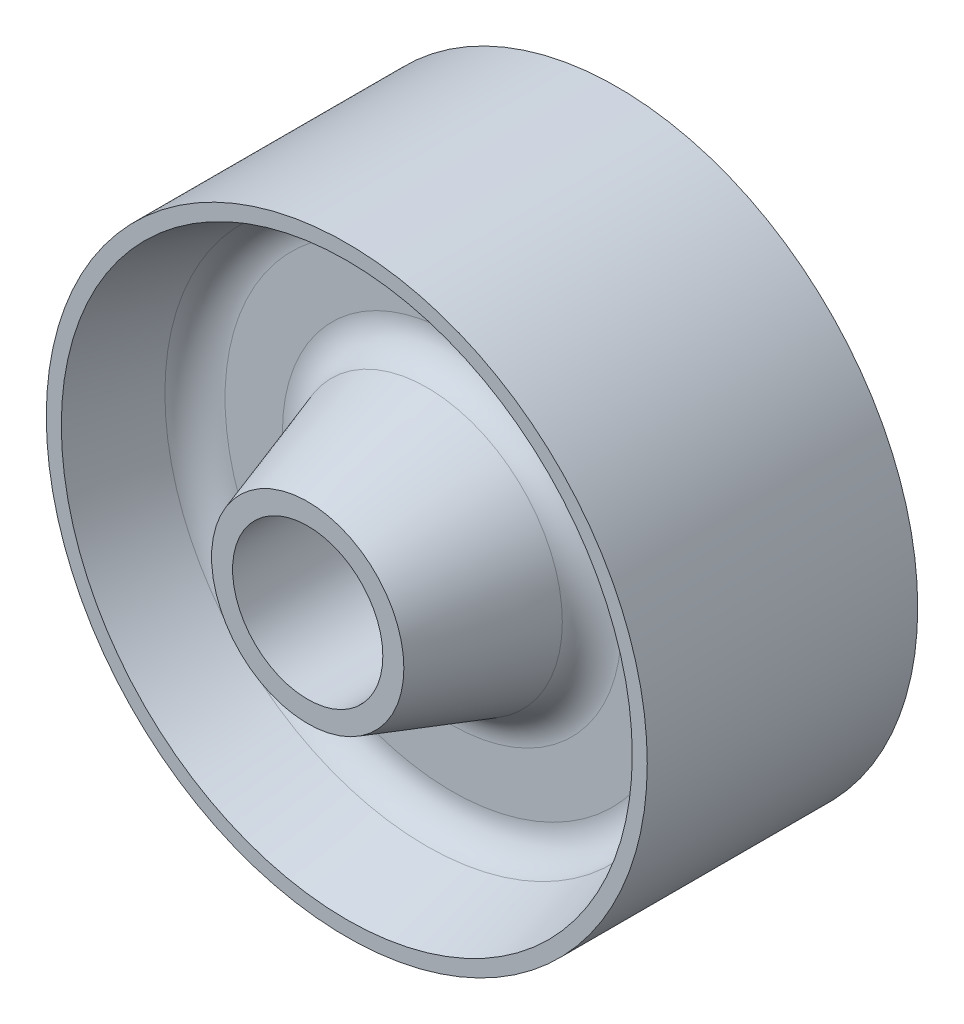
from build123d import *


with BuildPart() as part:
    # Sketch1 → Revolve1 (revolve)
    with BuildSketch(Plane(origin=(0, 0, 0), x_dir=(0, 0, -1), z_dir=(1, 0, 0)), mode=Mode.PRIVATE) as revolve1_sk:
        with BuildLine():
            Line((-22.5, 50), (22.5, 50))
            Line((22.5, 50), (22.5, 47.5))
            Line((22.5, 47.5), (9.264260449, 43.5))
            ThreePointArc((9.264260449, 43.5), (6.182612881, 41.333250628), (5, 37.756550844))
            Line((5, 37.756550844), (5, 28.202513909))
            ThreePointArc((5, 28.202513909), (6.142274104, 24.680795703), (9.134166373, 22.5))
            Line((9.134166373, 22.5), (29, 16))
            Line((29, 16), (29, 12.5))
            Line((29, 12.5), (-29, 12.5))
            Line((-29, 12.5), (-29, 16))
            Line((-29, 16), (-9.134166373, 22.5))
            ThreePointArc((-9.134166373, 22.5), (-6.142274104, 24.680795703), (-5, 28.202513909))
            Line((-5, 28.202513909), (-5, 37.756550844))
            ThreePointArc((-5, 37.756550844), (-6.182612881, 41.333250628), (-9.264260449, 43.5))
            Line((-9.264260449, 43.5), (-22.5, 47.5))
            Line((-22.5, 47.5), (-22.5, 50))
        make_face()
    revolve(revolve1_sk.sketch.rotate(Axis((0, 0, 41.444357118), (0, 0, -1)), 90), axis=Axis((0, 0, 41.444357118), (0, 0, -1)))


solid = part.part
